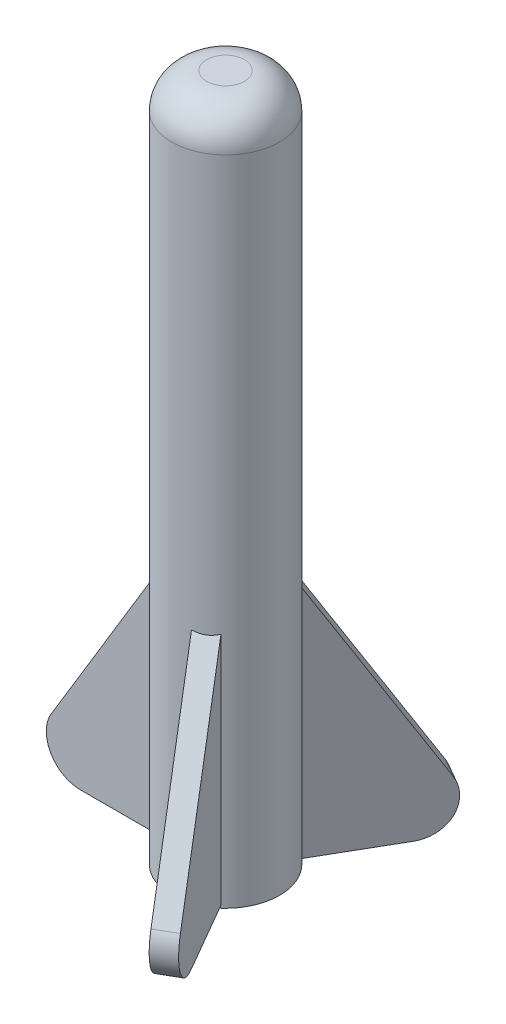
ISO-10303-21;
HEADER;
FILE_DESCRIPTION(('STEP AP214'),'2;1');
FILE_NAME('part.step','',(''),(''),'','','');
FILE_SCHEMA(('AUTOMOTIVE_DESIGN { 1 0 10303 214 1 1 1 1 }'));
ENDSEC;
DATA;
#1=APPLICATION_CONTEXT('core data for automotive mechanical design processes');
#2=APPLICATION_PROTOCOL_DEFINITION('international standard','automotive_design',2000,#1);
#3=PRODUCT_CONTEXT('',#1,'mechanical');
#4=PRODUCT('Part','Part','',(#3));
#5=PRODUCT_RELATED_PRODUCT_CATEGORY('part','',(#4));
#6=PRODUCT_DEFINITION_FORMATION('','',#4);
#7=PRODUCT_DEFINITION_CONTEXT('part definition',#1,'design');
#8=PRODUCT_DEFINITION('design','',#6,#7);
#9=PRODUCT_DEFINITION_SHAPE('','',#8);
#10=(LENGTH_UNIT() NAMED_UNIT(*) SI_UNIT(.MILLI.,.METRE.));
#11=(NAMED_UNIT(*) PLANE_ANGLE_UNIT() SI_UNIT($,.RADIAN.));
#12=(NAMED_UNIT(*) SI_UNIT($,.STERADIAN.) SOLID_ANGLE_UNIT());
#13=UNCERTAINTY_MEASURE_WITH_UNIT(LENGTH_MEASURE(1.E-05),#10,'distance_accuracy_value','');
#14=(GEOMETRIC_REPRESENTATION_CONTEXT(3) GLOBAL_UNCERTAINTY_ASSIGNED_CONTEXT((#13)) GLOBAL_UNIT_ASSIGNED_CONTEXT((#10,
#11,#12)) REPRESENTATION_CONTEXT('',''));
#15=CARTESIAN_POINT('',(0.,0.,0.));
#16=DIRECTION('',(0.,0.,1.));
#17=DIRECTION('',(1.,0.,0.));
#18=AXIS2_PLACEMENT_3D('',#15,#16,#17);
#19=CARTESIAN_POINT('',(0.,64.77,0.));
#20=DIRECTION('',(0.,-1.,0.));
#21=DIRECTION('',(0.,0.,-1.));
#22=AXIS2_PLACEMENT_3D('',#19,#20,#21);
#23=CYLINDRICAL_SURFACE('',#22,5.08);
#24=DIRECTION('',(0.,-1.,0.));
#25=VECTOR('',#24,1.);
#26=CARTESIAN_POINT('',(1.60879976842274,64.77,-4.81852293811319));
#27=LINE('',#26,#25);
#28=CARTESIAN_POINT('',(1.60879976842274,0.254000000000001,-4.81852293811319));
#29=VERTEX_POINT('',#28);
#30=CARTESIAN_POINT('',(1.60879976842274,22.3554057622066,-4.81852293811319));
#31=VERTEX_POINT('',#30);
#32=EDGE_CURVE('E227',#29,#31,#27,.F.);
#33=ORIENTED_EDGE('',*,*,#32,.F.);
#34=CARTESIAN_POINT('',(0.,0.254000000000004,0.));
#35=DIRECTION('',(0.,-1.,0.));
#36=DIRECTION('',(0.,0.,-1.));
#37=AXIS2_PLACEMENT_3D('',#34,#35,#36);
#38=CIRCLE('',#37,5.08);
#39=CARTESIAN_POINT('',(3.36856338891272,0.254000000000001,-3.80252293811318));
#40=VERTEX_POINT('',#39);
#41=EDGE_CURVE('E221',#29,#40,#38,.T.);
#42=ORIENTED_EDGE('',*,*,#41,.T.);
#43=DIRECTION('',(0.,-1.,0.));
#44=VECTOR('',#43,1.);
#45=CARTESIAN_POINT('',(3.36856338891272,64.77,-3.80252293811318));
#46=LINE('',#45,#44);
#47=CARTESIAN_POINT('',(3.36856338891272,22.3554057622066,-3.80252293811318));
#48=VERTEX_POINT('',#47);
#49=EDGE_CURVE('E218',#40,#48,#46,.F.);
#50=ORIENTED_EDGE('',*,*,#49,.T.);
#51=CARTESIAN_POINT('',(0.,30.595842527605,0.));
#52=DIRECTION('',(0.427986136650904,0.517021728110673,-0.741293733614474));
#53=DIRECTION('',(0.258510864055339,-0.855972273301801,-0.447753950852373));
#54=AXIS2_PLACEMENT_3D('',#51,#52,#53);
#55=ELLIPSE('',#54,9.82550582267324,5.08);
#56=EDGE_CURVE('E224',#48,#31,#55,.T.);
#57=ORIENTED_EDGE('',*,*,#56,.T.);
#58=EDGE_LOOP('',(#33,#42,#50,#57));
#59=FACE_BOUND('',#58,.T.);
#60=CARTESIAN_POINT('',(0.,0.,0.));
#61=DIRECTION('',(0.,1.,0.));
#62=DIRECTION('',(0.,0.,1.));
#63=AXIS2_PLACEMENT_3D('',#60,#61,#62);
#64=CIRCLE('',#63,5.08);
#65=CARTESIAN_POINT('',(0.,0.,5.08));
#66=VERTEX_POINT('',#65);
#67=EDGE_CURVE('E198',#66,#66,#64,.T.);
#68=ORIENTED_EDGE('',*,*,#67,.T.);
#69=EDGE_LOOP('',(#68));
#70=FACE_BOUND('',#69,.T.);
#71=CARTESIAN_POINT('',(0.,61.468,0.));
#72=DIRECTION('',(0.,1.,0.));
#73=DIRECTION('',(0.,0.,1.));
#74=AXIS2_PLACEMENT_3D('',#71,#72,#73);
#75=CIRCLE('',#74,5.08);
#76=CARTESIAN_POINT('',(0.,61.468,5.08));
#77=VERTEX_POINT('',#76);
#78=EDGE_CURVE('E204',#77,#77,#75,.F.);
#79=ORIENTED_EDGE('',*,*,#78,.T.);
#80=EDGE_LOOP('',(#79));
#81=FACE_BOUND('',#80,.T.);
#82=DIRECTION('',(0.,-1.,0.));
#83=VECTOR('',#82,1.);
#84=CARTESIAN_POINT('',(-4.97736315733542,64.77,1.016));
#85=LINE('',#84,#83);
#86=CARTESIAN_POINT('',(-4.97736315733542,0.254000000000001,1.016));
#87=VERTEX_POINT('',#86);
#88=CARTESIAN_POINT('',(-4.97736315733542,22.3554057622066,1.016));
#89=VERTEX_POINT('',#88);
#90=EDGE_CURVE('E216',#87,#89,#85,.F.);
#91=ORIENTED_EDGE('',*,*,#90,.F.);
#92=CARTESIAN_POINT('',(0.,0.254000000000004,0.));
#93=DIRECTION('',(0.,-1.,0.));
#94=DIRECTION('',(1.,0.,0.));
#95=AXIS2_PLACEMENT_3D('',#92,#93,#94);
#96=CIRCLE('',#95,5.08);
#97=CARTESIAN_POINT('',(-4.97736315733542,0.254000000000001,-1.016));
#98=VERTEX_POINT('',#97);
#99=EDGE_CURVE('E210',#87,#98,#96,.T.);
#100=ORIENTED_EDGE('',*,*,#99,.T.);
#101=DIRECTION('',(0.,-1.,0.));
#102=VECTOR('',#101,1.);
#103=CARTESIAN_POINT('',(-4.97736315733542,64.77,-1.016));
#104=LINE('',#103,#102);
#105=CARTESIAN_POINT('',(-4.97736315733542,22.3554057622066,-1.016));
#106=VERTEX_POINT('',#105);
#107=EDGE_CURVE('E207',#98,#106,#104,.F.);
#108=ORIENTED_EDGE('',*,*,#107,.T.);
#109=CARTESIAN_POINT('',(0.,30.595842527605,0.));
#110=DIRECTION('',(-0.855972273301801,0.517021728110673,0.));
#111=DIRECTION('',(-0.517021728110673,-0.855972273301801,0.));
#112=AXIS2_PLACEMENT_3D('',#109,#110,#111);
#113=ELLIPSE('',#112,9.82550582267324,5.08);
#114=EDGE_CURVE('E213',#106,#89,#113,.T.);
#115=ORIENTED_EDGE('',*,*,#114,.T.);
#116=EDGE_LOOP('',(#91,#100,#108,#115));
#117=FACE_BOUND('',#116,.T.);
#118=DIRECTION('',(0.,-1.,0.));
#119=VECTOR('',#118,1.);
#120=CARTESIAN_POINT('',(3.36856338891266,64.77,3.80252293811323));
#121=LINE('',#120,#119);
#122=CARTESIAN_POINT('',(3.36856338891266,0.254000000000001,3.80252293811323));
#123=VERTEX_POINT('',#122);
#124=CARTESIAN_POINT('',(3.36856338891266,22.3554057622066,3.80252293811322));
#125=VERTEX_POINT('',#124);
#126=EDGE_CURVE('E11',#123,#125,#121,.F.);
#127=ORIENTED_EDGE('',*,*,#126,.F.);
#128=CARTESIAN_POINT('',(0.,0.254000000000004,0.));
#129=DIRECTION('',(0.,-1.,0.));
#130=DIRECTION('',(0.,0.,-1.));
#131=AXIS2_PLACEMENT_3D('',#128,#129,#130);
#132=CIRCLE('',#131,5.08);
#133=CARTESIAN_POINT('',(1.60879976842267,0.254000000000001,4.81852293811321));
#134=VERTEX_POINT('',#133);
#135=EDGE_CURVE('E130',#123,#134,#132,.T.);
#136=ORIENTED_EDGE('',*,*,#135,.T.);
#137=DIRECTION('',(0.,-1.,0.));
#138=VECTOR('',#137,1.);
#139=CARTESIAN_POINT('',(1.60879976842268,64.77,4.81852293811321));
#140=LINE('',#139,#138);
#141=CARTESIAN_POINT('',(1.60879976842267,22.3554057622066,4.8185229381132));
#142=VERTEX_POINT('',#141);
#143=EDGE_CURVE('E229',#134,#142,#140,.F.);
#144=ORIENTED_EDGE('',*,*,#143,.T.);
#145=CARTESIAN_POINT('',(0.,30.595842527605,0.));
#146=DIRECTION('',(0.427986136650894,0.517021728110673,0.74129373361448));
#147=DIRECTION('',(0.258510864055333,-0.855972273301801,0.447753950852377));
#148=AXIS2_PLACEMENT_3D('',#145,#146,#147);
#149=ELLIPSE('',#148,9.82550582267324,5.08);
#150=EDGE_CURVE('E41',#142,#125,#149,.T.);
#151=ORIENTED_EDGE('',*,*,#150,.T.);
#152=EDGE_LOOP('',(#127,#136,#144,#151));
#153=FACE_BOUND('',#152,.T.);
#154=ADVANCED_FACE('F33',(#59,#70,#81,#117,#153),#23,.T.);
#155=CARTESIAN_POINT('',(0.,0.,0.));
#156=DIRECTION('',(0.,1.,0.));
#157=DIRECTION('',(0.,0.,1.));
#158=AXIS2_PLACEMENT_3D('',#155,#156,#157);
#159=PLANE('',#158);
#160=ORIENTED_EDGE('',*,*,#67,.F.);
#161=EDGE_LOOP('',(#160));
#162=FACE_BOUND('',#161,.T.);
#163=CARTESIAN_POINT('',(0.,0.,0.));
#164=DIRECTION('',(0.,-1.,0.));
#165=DIRECTION('',(1.,0.,0.));
#166=AXIS2_PLACEMENT_3D('',#163,#164,#165);
#167=CIRCLE('',#166,2.79399999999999);
#168=CARTESIAN_POINT('',(2.79399999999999,0.,0.));
#169=VERTEX_POINT('',#168);
#170=EDGE_CURVE('E190',#169,#169,#167,.T.);
#171=ORIENTED_EDGE('',*,*,#170,.F.);
#172=EDGE_LOOP('',(#171));
#173=FACE_BOUND('',#172,.T.);
#174=ADVANCED_FACE('F247',(#162,#173),#159,.F.);
#175=CARTESIAN_POINT('',(0.,64.77,0.));
#176=DIRECTION('',(0.,1.,0.));
#177=DIRECTION('',(0.,0.,1.));
#178=AXIS2_PLACEMENT_3D('',#175,#176,#177);
#179=PLANE('',#178);
#180=CARTESIAN_POINT('',(0.,64.77,0.));
#181=DIRECTION('',(0.,1.,0.));
#182=DIRECTION('',(0.,0.,1.));
#183=AXIS2_PLACEMENT_3D('',#180,#181,#182);
#184=CIRCLE('',#183,1.778);
#185=CARTESIAN_POINT('',(0.,64.77,1.778));
#186=VERTEX_POINT('',#185);
#187=EDGE_CURVE('E201',#186,#186,#184,.T.);
#188=ORIENTED_EDGE('',*,*,#187,.T.);
#189=EDGE_LOOP('',(#188));
#190=FACE_BOUND('',#189,.T.);
#191=ADVANCED_FACE('F252',(#190),#179,.T.);
#192=CARTESIAN_POINT('',(0.,61.468,0.));
#193=DIRECTION('',(0.,1.,0.));
#194=DIRECTION('',(0.,0.,1.));
#195=AXIS2_PLACEMENT_3D('',#192,#193,#194);
#196=DEGENERATE_TOROIDAL_SURFACE('',#195,1.778,3.302,.T.);
#197=ORIENTED_EDGE('',*,*,#78,.F.);
#198=EDGE_LOOP('',(#197));
#199=FACE_BOUND('',#198,.T.);
#200=ORIENTED_EDGE('',*,*,#187,.F.);
#201=EDGE_LOOP('',(#200));
#202=FACE_BOUND('',#201,.T.);
#203=ADVANCED_FACE('F35',(#199,#202),#196,.T.);
#204=CARTESIAN_POINT('',(0.,33.0835,0.));
#205=DIRECTION('',(0.,-1.,0.));
#206=DIRECTION('',(1.,0.,0.));
#207=AXIS2_PLACEMENT_3D('',#204,#205,#206);
#208=PLANE('',#207);
#209=CARTESIAN_POINT('',(0.,33.0835,0.));
#210=DIRECTION('',(0.,-1.,0.));
#211=DIRECTION('',(1.,0.,0.));
#212=AXIS2_PLACEMENT_3D('',#209,#210,#211);
#213=CIRCLE('',#212,2.794);
#214=CARTESIAN_POINT('',(2.794,33.0835,0.));
#215=VERTEX_POINT('',#214);
#216=EDGE_CURVE('E195',#215,#215,#213,.T.);
#217=ORIENTED_EDGE('',*,*,#216,.T.);
#218=EDGE_LOOP('',(#217));
#219=FACE_BOUND('',#218,.T.);
#220=ADVANCED_FACE('F261',(#219),#208,.T.);
#221=CARTESIAN_POINT('',(0.,33.0835,0.));
#222=DIRECTION('',(0.,-1.,0.));
#223=DIRECTION('',(1.,0.,0.));
#224=AXIS2_PLACEMENT_3D('',#221,#222,#223);
#225=CYLINDRICAL_SURFACE('',#224,2.79399999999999);
#226=ORIENTED_EDGE('',*,*,#170,.T.);
#227=EDGE_LOOP('',(#226));
#228=FACE_BOUND('',#227,.T.);
#229=ORIENTED_EDGE('',*,*,#216,.F.);
#230=EDGE_LOOP('',(#229));
#231=FACE_BOUND('',#230,.T.);
#232=ADVANCED_FACE('F264',(#228,#231),#225,.F.);
#233=CARTESIAN_POINT('',(-15.4177119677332,5.07054398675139,1.016));
#234=DIRECTION('',(-0.855972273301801,0.517021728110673,0.));
#235=DIRECTION('',(-0.517021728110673,-0.855972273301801,0.));
#236=AXIS2_PLACEMENT_3D('',#233,#234,#235);
#237=PLANE('',#236);
#238=ORIENTED_EDGE('',*,*,#114,.F.);
#239=DIRECTION('',(0.517021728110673,0.855972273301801,0.));
#240=VECTOR('',#239,1.);
#241=CARTESIAN_POINT('',(-15.4177119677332,5.07054398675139,-1.016));
#242=LINE('',#241,#240);
#243=CARTESIAN_POINT('',(-15.4177119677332,5.07054398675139,-1.016));
#244=VERTEX_POINT('',#243);
#245=EDGE_CURVE('E176',#244,#106,#242,.T.);
#246=ORIENTED_EDGE('',*,*,#245,.F.);
#247=DIRECTION('',(0.,0.,-1.));
#248=VECTOR('',#247,1.);
#249=CARTESIAN_POINT('',(-15.4177119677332,5.07054398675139,1.016));
#250=LINE('',#249,#248);
#251=CARTESIAN_POINT('',(-15.4177119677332,5.07054398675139,1.016));
#252=VERTEX_POINT('',#251);
#253=EDGE_CURVE('E188',#252,#244,#250,.T.);
#254=ORIENTED_EDGE('',*,*,#253,.F.);
#255=DIRECTION('',(0.517021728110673,0.855972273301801,0.));
#256=VECTOR('',#255,1.);
#257=CARTESIAN_POINT('',(-15.4177119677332,5.07054398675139,1.016));
#258=LINE('',#257,#256);
#259=EDGE_CURVE('E179',#252,#89,#258,.T.);
#260=ORIENTED_EDGE('',*,*,#259,.T.);
#261=EDGE_LOOP('',(#238,#246,#254,#260));
#262=FACE_BOUND('',#261,.T.);
#263=ADVANCED_FACE('F268',(#262),#237,.T.);
#264=CARTESIAN_POINT('',(-4.826,0.254000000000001,1.016));
#265=DIRECTION('',(0.,-1.,0.));
#266=DIRECTION('',(1.,0.,0.));
#267=AXIS2_PLACEMENT_3D('',#264,#265,#266);
#268=PLANE('',#267);
#269=ORIENTED_EDGE('',*,*,#99,.F.);
#270=DIRECTION('',(-1.,0.,0.));
#271=VECTOR('',#270,1.);
#272=CARTESIAN_POINT('',(-4.826,0.254000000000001,1.016));
#273=LINE('',#272,#271);
#274=CARTESIAN_POINT('',(-12.7,0.253999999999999,1.016));
#275=VERTEX_POINT('',#274);
#276=EDGE_CURVE('E173',#87,#275,#273,.T.);
#277=ORIENTED_EDGE('',*,*,#276,.T.);
#278=DIRECTION('',(0.,0.,-1.));
#279=VECTOR('',#278,1.);
#280=CARTESIAN_POINT('',(-12.7,0.253999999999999,1.016));
#281=LINE('',#280,#279);
#282=CARTESIAN_POINT('',(-12.7,0.253999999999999,-1.016));
#283=VERTEX_POINT('',#282);
#284=EDGE_CURVE('E182',#275,#283,#281,.T.);
#285=ORIENTED_EDGE('',*,*,#284,.T.);
#286=DIRECTION('',(-1.,0.,0.));
#287=VECTOR('',#286,1.);
#288=CARTESIAN_POINT('',(-4.826,0.254000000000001,-1.016));
#289=LINE('',#288,#287);
#290=EDGE_CURVE('E170',#98,#283,#289,.T.);
#291=ORIENTED_EDGE('',*,*,#290,.F.);
#292=EDGE_LOOP('',(#269,#277,#285,#291));
#293=FACE_BOUND('',#292,.T.);
#294=ADVANCED_FACE('F270',(#293),#268,.T.);
#295=CARTESIAN_POINT('',(-12.7,3.429,1.016));
#296=DIRECTION('',(0.,0.,-1.));
#297=DIRECTION('',(-1.,0.,0.));
#298=AXIS2_PLACEMENT_3D('',#295,#296,#297);
#299=PLANE('',#298);
#300=ORIENTED_EDGE('',*,*,#276,.F.);
#301=ORIENTED_EDGE('',*,*,#90,.T.);
#302=ORIENTED_EDGE('',*,*,#259,.F.);
#303=CARTESIAN_POINT('',(-12.7,3.429,1.016));
#304=DIRECTION('',(0.,0.,-1.));
#305=DIRECTION('',(-1.,0.,0.));
#306=AXIS2_PLACEMENT_3D('',#303,#304,#305);
#307=CIRCLE('',#306,3.175);
#308=EDGE_CURVE('E175',#275,#252,#307,.T.);
#309=ORIENTED_EDGE('',*,*,#308,.F.);
#310=EDGE_LOOP('',(#300,#301,#302,#309));
#311=FACE_BOUND('',#310,.T.);
#312=ADVANCED_FACE('F273',(#311),#299,.F.);
#313=CARTESIAN_POINT('',(-12.7,3.429,-1.016));
#314=DIRECTION('',(0.,0.,-1.));
#315=DIRECTION('',(-1.,0.,0.));
#316=AXIS2_PLACEMENT_3D('',#313,#314,#315);
#317=PLANE('',#316);
#318=ORIENTED_EDGE('',*,*,#107,.F.);
#319=ORIENTED_EDGE('',*,*,#290,.T.);
#320=CARTESIAN_POINT('',(-12.7,3.429,-1.016));
#321=DIRECTION('',(0.,0.,-1.));
#322=DIRECTION('',(-1.,0.,0.));
#323=AXIS2_PLACEMENT_3D('',#320,#321,#322);
#324=CIRCLE('',#323,3.175);
#325=EDGE_CURVE('E184',#283,#244,#324,.T.);
#326=ORIENTED_EDGE('',*,*,#325,.T.);
#327=ORIENTED_EDGE('',*,*,#245,.T.);
#328=EDGE_LOOP('',(#318,#319,#326,#327));
#329=FACE_BOUND('',#328,.T.);
#330=ADVANCED_FACE('F279',(#329),#317,.T.);
#331=CARTESIAN_POINT('',(-12.7,3.429,1.016));
#332=DIRECTION('',(0.,0.,-1.));
#333=DIRECTION('',(-1.,0.,0.));
#334=AXIS2_PLACEMENT_3D('',#331,#332,#333);
#335=CYLINDRICAL_SURFACE('',#334,3.175);
#336=ORIENTED_EDGE('',*,*,#325,.F.);
#337=ORIENTED_EDGE('',*,*,#284,.F.);
#338=ORIENTED_EDGE('',*,*,#308,.T.);
#339=ORIENTED_EDGE('',*,*,#253,.T.);
#340=EDGE_LOOP('',(#336,#337,#338,#339));
#341=FACE_BOUND('',#340,.T.);
#342=ADVANCED_FACE('F275',(#341),#335,.T.);
#343=CARTESIAN_POINT('',(6.82897417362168,5.07054398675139,-13.8601302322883));
#344=DIRECTION('',(0.427986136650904,0.517021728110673,-0.741293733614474));
#345=DIRECTION('',(0.,0.820209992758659,0.572062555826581));
#346=AXIS2_PLACEMENT_3D('',#343,#344,#345);
#347=PLANE('',#346);
#348=ORIENTED_EDGE('',*,*,#56,.F.);
#349=DIRECTION('',(-0.258510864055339,0.855972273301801,0.447753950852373));
#350=VECTOR('',#349,1.);
#351=CARTESIAN_POINT('',(8.58873779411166,5.07054398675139,-12.8441302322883));
#352=LINE('',#351,#350);
#353=CARTESIAN_POINT('',(8.58873779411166,5.07054398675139,-12.8441302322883));
#354=VERTEX_POINT('',#353);
#355=EDGE_CURVE('E56',#354,#48,#352,.T.);
#356=ORIENTED_EDGE('',*,*,#355,.F.);
#357=DIRECTION('',(0.866025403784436,0.,0.500000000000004));
#358=VECTOR('',#357,1.);
#359=CARTESIAN_POINT('',(6.82897417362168,5.07054398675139,-13.8601302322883));
#360=LINE('',#359,#358);
#361=CARTESIAN_POINT('',(6.82897417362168,5.07054398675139,-13.8601302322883));
#362=VERTEX_POINT('',#361);
#363=EDGE_CURVE('E168',#362,#354,#360,.T.);
#364=ORIENTED_EDGE('',*,*,#363,.F.);
#365=DIRECTION('',(-0.258510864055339,0.855972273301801,0.447753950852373));
#366=VECTOR('',#365,1.);
#367=CARTESIAN_POINT('',(6.82897417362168,5.07054398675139,-13.8601302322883));
#368=LINE('',#367,#366);
#369=EDGE_CURVE('E160',#362,#31,#368,.T.);
#370=ORIENTED_EDGE('',*,*,#369,.T.);
#371=EDGE_LOOP('',(#348,#356,#364,#370));
#372=FACE_BOUND('',#371,.T.);
#373=ADVANCED_FACE('F278',(#372),#347,.T.);
#374=CARTESIAN_POINT('',(1.53311818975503,0.254000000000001,-4.68743859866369));
#375=DIRECTION('',(0.,-1.,0.));
#376=DIRECTION('',(0.,0.,-1.));
#377=AXIS2_PLACEMENT_3D('',#374,#375,#376);
#378=PLANE('',#377);
#379=ORIENTED_EDGE('',*,*,#41,.F.);
#380=DIRECTION('',(0.500000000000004,0.,-0.866025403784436));
#381=VECTOR('',#380,1.);
#382=CARTESIAN_POINT('',(1.53311818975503,0.254000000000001,-4.68743859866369));
#383=LINE('',#382,#381);
#384=CARTESIAN_POINT('',(5.47011818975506,0.253999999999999,-11.5065226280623));
#385=VERTEX_POINT('',#384);
#386=EDGE_CURVE('E155',#29,#385,#383,.T.);
#387=ORIENTED_EDGE('',*,*,#386,.T.);
#388=DIRECTION('',(0.866025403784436,0.,0.500000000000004));
#389=VECTOR('',#388,1.);
#390=CARTESIAN_POINT('',(5.47011818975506,0.253999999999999,-11.5065226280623));
#391=LINE('',#390,#389);
#392=CARTESIAN_POINT('',(7.22988181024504,0.253999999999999,-10.4905226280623));
#393=VERTEX_POINT('',#392);
#394=EDGE_CURVE('E163',#385,#393,#391,.T.);
#395=ORIENTED_EDGE('',*,*,#394,.T.);
#396=DIRECTION('',(0.500000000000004,0.,-0.866025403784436));
#397=VECTOR('',#396,1.);
#398=CARTESIAN_POINT('',(3.29288181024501,0.254000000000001,-3.67143859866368));
#399=LINE('',#398,#397);
#400=EDGE_CURVE('E153',#40,#393,#399,.T.);
#401=ORIENTED_EDGE('',*,*,#400,.F.);
#402=EDGE_LOOP('',(#379,#387,#395,#401));
#403=FACE_BOUND('',#402,.T.);
#404=ADVANCED_FACE('F290',(#403),#378,.T.);
#405=CARTESIAN_POINT('',(5.47011818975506,3.429,-11.5065226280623));
#406=DIRECTION('',(0.866025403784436,0.,0.500000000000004));
#407=DIRECTION('',(0.500000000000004,0.,-0.866025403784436));
#408=AXIS2_PLACEMENT_3D('',#405,#406,#407);
#409=PLANE('',#408);
#410=ORIENTED_EDGE('',*,*,#386,.F.);
#411=ORIENTED_EDGE('',*,*,#32,.T.);
#412=ORIENTED_EDGE('',*,*,#369,.F.);
#413=CARTESIAN_POINT('',(5.47011818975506,3.429,-11.5065226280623));
#414=DIRECTION('',(0.866025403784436,0.,0.500000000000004));
#415=DIRECTION('',(0.500000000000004,0.,-0.866025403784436));
#416=AXIS2_PLACEMENT_3D('',#413,#414,#415);
#417=CIRCLE('',#416,3.175);
#418=EDGE_CURVE('E157',#385,#362,#417,.T.);
#419=ORIENTED_EDGE('',*,*,#418,.F.);
#420=EDGE_LOOP('',(#410,#411,#412,#419));
#421=FACE_BOUND('',#420,.T.);
#422=ADVANCED_FACE('F293',(#421),#409,.F.);
#423=CARTESIAN_POINT('',(7.22988181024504,3.429,-10.4905226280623));
#424=DIRECTION('',(0.866025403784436,0.,0.500000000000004));
#425=DIRECTION('',(0.500000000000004,0.,-0.866025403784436));
#426=AXIS2_PLACEMENT_3D('',#423,#424,#425);
#427=PLANE('',#426);
#428=ORIENTED_EDGE('',*,*,#49,.F.);
#429=ORIENTED_EDGE('',*,*,#400,.T.);
#430=CARTESIAN_POINT('',(7.22988181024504,3.429,-10.4905226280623));
#431=DIRECTION('',(0.866025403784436,0.,0.500000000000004));
#432=DIRECTION('',(0.500000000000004,0.,-0.866025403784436));
#433=AXIS2_PLACEMENT_3D('',#430,#431,#432);
#434=CIRCLE('',#433,3.175);
#435=EDGE_CURVE('E165',#393,#354,#434,.T.);
#436=ORIENTED_EDGE('',*,*,#435,.T.);
#437=ORIENTED_EDGE('',*,*,#355,.T.);
#438=EDGE_LOOP('',(#428,#429,#436,#437));
#439=FACE_BOUND('',#438,.T.);
#440=ADVANCED_FACE('F298',(#439),#427,.T.);
#441=CARTESIAN_POINT('',(5.47011818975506,3.429,-11.5065226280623));
#442=DIRECTION('',(0.866025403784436,0.,0.500000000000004));
#443=DIRECTION('',(0.500000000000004,0.,-0.866025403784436));
#444=AXIS2_PLACEMENT_3D('',#441,#442,#443);
#445=CYLINDRICAL_SURFACE('',#444,3.175);
#446=ORIENTED_EDGE('',*,*,#435,.F.);
#447=ORIENTED_EDGE('',*,*,#394,.F.);
#448=ORIENTED_EDGE('',*,*,#418,.T.);
#449=ORIENTED_EDGE('',*,*,#363,.T.);
#450=EDGE_LOOP('',(#446,#447,#448,#449));
#451=FACE_BOUND('',#450,.T.);
#452=ADVANCED_FACE('F295',(#451),#445,.T.);
#453=CARTESIAN_POINT('',(8.58873779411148,5.07054398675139,12.8441302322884));
#454=DIRECTION('',(0.427986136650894,0.517021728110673,0.74129373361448));
#455=DIRECTION('',(0.,-0.820209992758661,0.572062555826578));
#456=AXIS2_PLACEMENT_3D('',#453,#454,#455);
#457=PLANE('',#456);
#458=ORIENTED_EDGE('',*,*,#150,.F.);
#459=DIRECTION('',(-0.258510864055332,0.855972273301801,-0.447753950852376));
#460=VECTOR('',#459,1.);
#461=CARTESIAN_POINT('',(6.82897417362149,5.07054398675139,13.8601302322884));
#462=LINE('',#461,#460);
#463=CARTESIAN_POINT('',(6.82897417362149,5.07054398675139,13.8601302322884));
#464=VERTEX_POINT('',#463);
#465=EDGE_CURVE('E48',#464,#142,#462,.T.);
#466=ORIENTED_EDGE('',*,*,#465,.F.);
#467=DIRECTION('',(-0.866025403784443,0.,0.499999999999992));
#468=VECTOR('',#467,1.);
#469=CARTESIAN_POINT('',(8.58873779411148,5.07054398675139,12.8441302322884));
#470=LINE('',#469,#468);
#471=CARTESIAN_POINT('',(8.58873779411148,5.07054398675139,12.8441302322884));
#472=VERTEX_POINT('',#471);
#473=EDGE_CURVE('E141',#472,#464,#470,.T.);
#474=ORIENTED_EDGE('',*,*,#473,.F.);
#475=DIRECTION('',(-0.258510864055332,0.855972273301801,-0.447753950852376));
#476=VECTOR('',#475,1.);
#477=CARTESIAN_POINT('',(8.58873779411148,5.07054398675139,12.8441302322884));
#478=LINE('',#477,#476);
#479=EDGE_CURVE('E142',#472,#125,#478,.T.);
#480=ORIENTED_EDGE('',*,*,#479,.T.);
#481=EDGE_LOOP('',(#458,#466,#474,#480));
#482=FACE_BOUND('',#481,.T.);
#483=ADVANCED_FACE('F235',(#482),#457,.T.);
#484=CARTESIAN_POINT('',(3.29288181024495,0.254000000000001,3.67143859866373));
#485=DIRECTION('',(0.,-1.,0.));
#486=DIRECTION('',(0.,0.,-1.));
#487=AXIS2_PLACEMENT_3D('',#484,#485,#486);
#488=PLANE('',#487);
#489=ORIENTED_EDGE('',*,*,#135,.F.);
#490=DIRECTION('',(0.499999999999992,0.,0.866025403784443));
#491=VECTOR('',#490,1.);
#492=CARTESIAN_POINT('',(3.29288181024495,0.254000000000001,3.67143859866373));
#493=LINE('',#492,#491);
#494=CARTESIAN_POINT('',(7.22988181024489,0.253999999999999,10.4905226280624));
#495=VERTEX_POINT('',#494);
#496=EDGE_CURVE('E123',#123,#495,#493,.T.);
#497=ORIENTED_EDGE('',*,*,#496,.T.);
#498=DIRECTION('',(-0.866025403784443,0.,0.499999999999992));
#499=VECTOR('',#498,1.);
#500=CARTESIAN_POINT('',(7.22988181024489,0.253999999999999,10.4905226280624));
#501=LINE('',#500,#499);
#502=CARTESIAN_POINT('',(5.4701181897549,0.253999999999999,11.5065226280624));
#503=VERTEX_POINT('',#502);
#504=EDGE_CURVE('E127',#495,#503,#501,.T.);
#505=ORIENTED_EDGE('',*,*,#504,.T.);
#506=DIRECTION('',(0.499999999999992,0.,0.866025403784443));
#507=VECTOR('',#506,1.);
#508=CARTESIAN_POINT('',(1.53311818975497,0.254000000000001,4.68743859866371));
#509=LINE('',#508,#507);
#510=EDGE_CURVE('E149',#134,#503,#509,.T.);
#511=ORIENTED_EDGE('',*,*,#510,.F.);
#512=EDGE_LOOP('',(#489,#497,#505,#511));
#513=FACE_BOUND('',#512,.T.);
#514=ADVANCED_FACE('F125',(#513),#488,.T.);
#515=CARTESIAN_POINT('',(7.22988181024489,3.429,10.4905226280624));
#516=DIRECTION('',(-0.866025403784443,0.,0.499999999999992));
#517=DIRECTION('',(0.499999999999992,0.,0.866025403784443));
#518=AXIS2_PLACEMENT_3D('',#515,#516,#517);
#519=PLANE('',#518);
#520=ORIENTED_EDGE('',*,*,#496,.F.);
#521=ORIENTED_EDGE('',*,*,#126,.T.);
#522=ORIENTED_EDGE('',*,*,#479,.F.);
#523=CARTESIAN_POINT('',(7.22988181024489,3.429,10.4905226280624));
#524=DIRECTION('',(-0.866025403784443,0.,0.499999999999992));
#525=DIRECTION('',(0.499999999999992,0.,0.866025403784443));
#526=AXIS2_PLACEMENT_3D('',#523,#524,#525);
#527=CIRCLE('',#526,3.175);
#528=EDGE_CURVE('E134',#495,#472,#527,.T.);
#529=ORIENTED_EDGE('',*,*,#528,.F.);
#530=EDGE_LOOP('',(#520,#521,#522,#529));
#531=FACE_BOUND('',#530,.T.);
#532=ADVANCED_FACE('F144',(#531),#519,.F.);
#533=CARTESIAN_POINT('',(5.4701181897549,3.429,11.5065226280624));
#534=DIRECTION('',(-0.866025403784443,0.,0.499999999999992));
#535=DIRECTION('',(0.499999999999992,0.,0.866025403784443));
#536=AXIS2_PLACEMENT_3D('',#533,#534,#535);
#537=PLANE('',#536);
#538=ORIENTED_EDGE('',*,*,#143,.F.);
#539=ORIENTED_EDGE('',*,*,#510,.T.);
#540=CARTESIAN_POINT('',(5.4701181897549,3.429,11.5065226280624));
#541=DIRECTION('',(-0.866025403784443,0.,0.499999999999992));
#542=DIRECTION('',(0.499999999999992,0.,0.866025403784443));
#543=AXIS2_PLACEMENT_3D('',#540,#541,#542);
#544=CIRCLE('',#543,3.175);
#545=EDGE_CURVE('E140',#503,#464,#544,.T.);
#546=ORIENTED_EDGE('',*,*,#545,.T.);
#547=ORIENTED_EDGE('',*,*,#465,.T.);
#548=EDGE_LOOP('',(#538,#539,#546,#547));
#549=FACE_BOUND('',#548,.T.);
#550=ADVANCED_FACE('F236',(#549),#537,.T.);
#551=CARTESIAN_POINT('',(7.22988181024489,3.429,10.4905226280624));
#552=DIRECTION('',(-0.866025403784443,0.,0.499999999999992));
#553=DIRECTION('',(0.499999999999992,0.,0.866025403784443));
#554=AXIS2_PLACEMENT_3D('',#551,#552,#553);
#555=CYLINDRICAL_SURFACE('',#554,3.175);
#556=ORIENTED_EDGE('',*,*,#545,.F.);
#557=ORIENTED_EDGE('',*,*,#504,.F.);
#558=ORIENTED_EDGE('',*,*,#528,.T.);
#559=ORIENTED_EDGE('',*,*,#473,.T.);
#560=EDGE_LOOP('',(#556,#557,#558,#559));
#561=FACE_BOUND('',#560,.T.);
#562=ADVANCED_FACE('F138',(#561),#555,.T.);
#563=CLOSED_SHELL('',(#154,#174,#191,#203,#220,#232,#263,#294,#312,#330,#342,#373,#404,#422,
#440,#452,#483,#514,#532,#550,#562));
#564=MANIFOLD_SOLID_BREP('B2',#563);
#565=ADVANCED_BREP_SHAPE_REPRESENTATION('',(#18,#564),#14);
#566=SHAPE_DEFINITION_REPRESENTATION(#9,#565);
ENDSEC;
END-ISO-10303-21;
